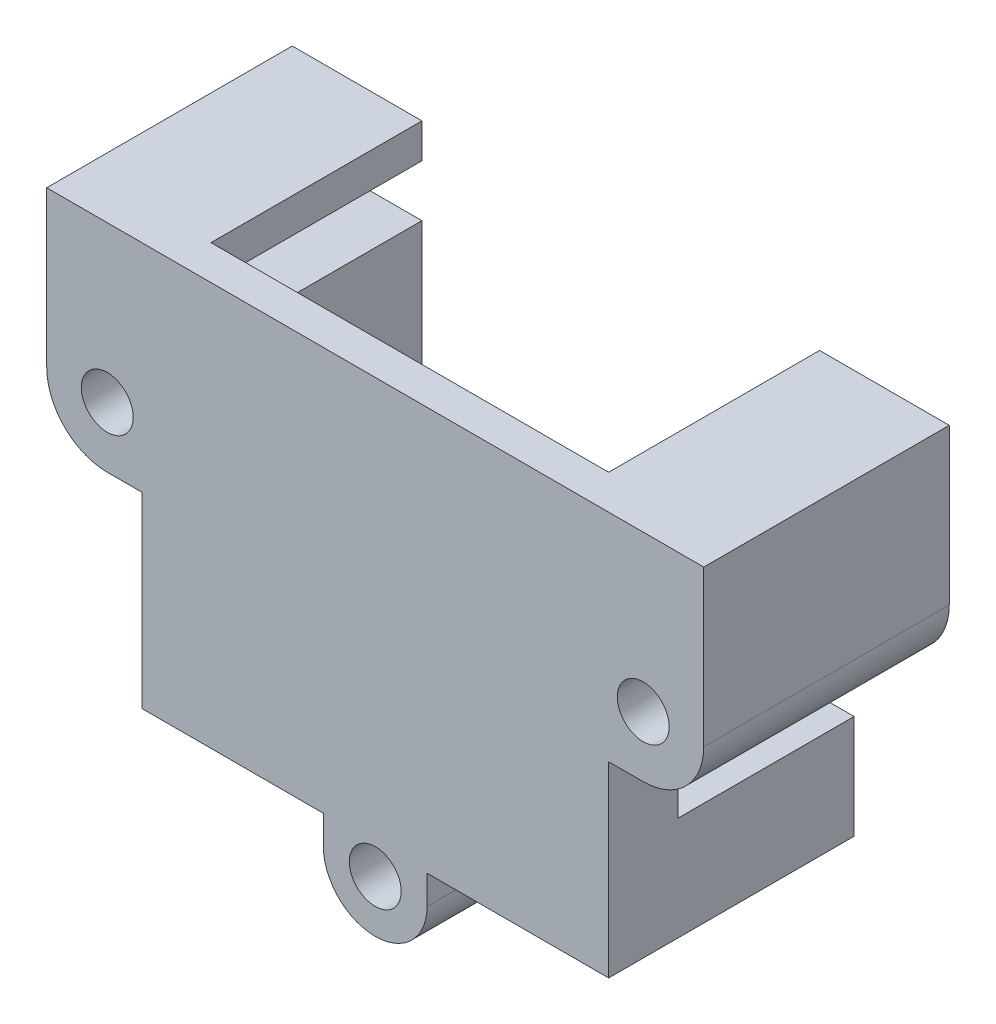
ISO-10303-21;
HEADER;
FILE_DESCRIPTION(('STEP AP214'),'2;1');
FILE_NAME('part.step','',(''),(''),'','','');
FILE_SCHEMA(('AUTOMOTIVE_DESIGN { 1 0 10303 214 1 1 1 1 }'));
ENDSEC;
DATA;
#1=APPLICATION_CONTEXT('core data for automotive mechanical design processes');
#2=APPLICATION_PROTOCOL_DEFINITION('international standard','automotive_design',2000,#1);
#3=PRODUCT_CONTEXT('',#1,'mechanical');
#4=PRODUCT('Part','Part','',(#3));
#5=PRODUCT_RELATED_PRODUCT_CATEGORY('part','',(#4));
#6=PRODUCT_DEFINITION_FORMATION('','',#4);
#7=PRODUCT_DEFINITION_CONTEXT('part definition',#1,'design');
#8=PRODUCT_DEFINITION('design','',#6,#7);
#9=PRODUCT_DEFINITION_SHAPE('','',#8);
#10=(LENGTH_UNIT() NAMED_UNIT(*) SI_UNIT(.MILLI.,.METRE.));
#11=(NAMED_UNIT(*) PLANE_ANGLE_UNIT() SI_UNIT($,.RADIAN.));
#12=(NAMED_UNIT(*) SI_UNIT($,.STERADIAN.) SOLID_ANGLE_UNIT());
#13=UNCERTAINTY_MEASURE_WITH_UNIT(LENGTH_MEASURE(1.E-05),#10,'distance_accuracy_value','');
#14=(GEOMETRIC_REPRESENTATION_CONTEXT(3) GLOBAL_UNCERTAINTY_ASSIGNED_CONTEXT((#13)) GLOBAL_UNIT_ASSIGNED_CONTEXT((#10,
#11,#12)) REPRESENTATION_CONTEXT('',''));
#15=CARTESIAN_POINT('',(0.,0.,0.));
#16=DIRECTION('',(0.,0.,1.));
#17=DIRECTION('',(1.,0.,0.));
#18=AXIS2_PLACEMENT_3D('',#15,#16,#17);
#19=CARTESIAN_POINT('',(-15.5,13.5,8.));
#20=DIRECTION('',(0.,0.,1.));
#21=DIRECTION('',(1.,0.,0.));
#22=AXIS2_PLACEMENT_3D('',#19,#20,#21);
#23=PLANE('',#22);
#24=DIRECTION('',(0.,-1.,0.));
#25=VECTOR('',#24,1.);
#26=CARTESIAN_POINT('',(11.5,17.5,8.));
#27=LINE('',#26,#25);
#28=CARTESIAN_POINT('',(11.5,17.5,8.));
#29=VERTEX_POINT('',#28);
#30=CARTESIAN_POINT('',(11.5,0.499999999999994,8.));
#31=VERTEX_POINT('',#30);
#32=EDGE_CURVE('E443',#29,#31,#27,.T.);
#33=ORIENTED_EDGE('',*,*,#32,.T.);
#34=DIRECTION('',(-1.,0.,0.));
#35=VECTOR('',#34,1.);
#36=CARTESIAN_POINT('',(11.5,0.499999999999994,8.));
#37=LINE('',#36,#35);
#38=CARTESIAN_POINT('',(-11.5,0.499999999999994,8.));
#39=VERTEX_POINT('',#38);
#40=EDGE_CURVE('E389',#31,#39,#37,.T.);
#41=ORIENTED_EDGE('',*,*,#40,.T.);
#42=DIRECTION('',(0.,1.,0.));
#43=VECTOR('',#42,1.);
#44=CARTESIAN_POINT('',(-11.5,0.499999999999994,8.));
#45=LINE('',#44,#43);
#46=CARTESIAN_POINT('',(-11.5,17.5,8.));
#47=VERTEX_POINT('',#46);
#48=EDGE_CURVE('E391',#39,#47,#45,.T.);
#49=ORIENTED_EDGE('',*,*,#48,.T.);
#50=DIRECTION('',(-1.,0.,0.));
#51=VECTOR('',#50,1.);
#52=CARTESIAN_POINT('',(-11.5,17.5,8.));
#53=LINE('',#52,#51);
#54=CARTESIAN_POINT('',(-17.,17.5,8.));
#55=VERTEX_POINT('',#54);
#56=EDGE_CURVE('E377',#47,#55,#53,.T.);
#57=ORIENTED_EDGE('',*,*,#56,.T.);
#58=DIRECTION('',(0.,1.,0.));
#59=VECTOR('',#58,1.);
#60=CARTESIAN_POINT('',(-17.,17.5,8.));
#61=LINE('',#60,#59);
#62=CARTESIAN_POINT('',(-17.,20.5,8.));
#63=VERTEX_POINT('',#62);
#64=EDGE_CURVE('E380',#55,#63,#61,.T.);
#65=ORIENTED_EDGE('',*,*,#64,.T.);
#66=DIRECTION('',(1.,0.,0.));
#67=VECTOR('',#66,1.);
#68=CARTESIAN_POINT('',(-11.5,20.5,8.));
#69=LINE('',#68,#67);
#70=CARTESIAN_POINT('',(-11.5,20.5,8.));
#71=VERTEX_POINT('',#70);
#72=EDGE_CURVE('E383',#63,#71,#69,.T.);
#73=ORIENTED_EDGE('',*,*,#72,.T.);
#74=DIRECTION('',(0.,1.,0.));
#75=VECTOR('',#74,1.);
#76=CARTESIAN_POINT('',(-11.5,22.5,8.));
#77=LINE('',#76,#75);
#78=CARTESIAN_POINT('',(-11.5,22.5,8.));
#79=VERTEX_POINT('',#78);
#80=EDGE_CURVE('E386',#71,#79,#77,.T.);
#81=ORIENTED_EDGE('',*,*,#80,.T.);
#82=DIRECTION('',(-1.,0.,0.));
#83=VECTOR('',#82,1.);
#84=CARTESIAN_POINT('',(-11.5,22.5,8.));
#85=LINE('',#84,#83);
#86=CARTESIAN_POINT('',(11.5,22.5,8.));
#87=VERTEX_POINT('',#86);
#88=EDGE_CURVE('E413',#87,#79,#85,.T.);
#89=ORIENTED_EDGE('',*,*,#88,.F.);
#90=DIRECTION('',(0.,-1.,0.));
#91=VECTOR('',#90,1.);
#92=CARTESIAN_POINT('',(11.5,22.5,8.));
#93=LINE('',#92,#91);
#94=CARTESIAN_POINT('',(11.5,20.5,8.));
#95=VERTEX_POINT('',#94);
#96=EDGE_CURVE('E445',#87,#95,#93,.T.);
#97=ORIENTED_EDGE('',*,*,#96,.T.);
#98=DIRECTION('',(1.,0.,0.));
#99=VECTOR('',#98,1.);
#100=CARTESIAN_POINT('',(11.5,20.5,8.));
#101=LINE('',#100,#99);
#102=CARTESIAN_POINT('',(17.,20.5,8.));
#103=VERTEX_POINT('',#102);
#104=EDGE_CURVE('E448',#95,#103,#101,.T.);
#105=ORIENTED_EDGE('',*,*,#104,.T.);
#106=DIRECTION('',(0.,-1.,0.));
#107=VECTOR('',#106,1.);
#108=CARTESIAN_POINT('',(17.,20.5,8.));
#109=LINE('',#108,#107);
#110=CARTESIAN_POINT('',(17.,17.5,8.));
#111=VERTEX_POINT('',#110);
#112=EDGE_CURVE('E451',#103,#111,#109,.T.);
#113=ORIENTED_EDGE('',*,*,#112,.T.);
#114=DIRECTION('',(-1.,0.,0.));
#115=VECTOR('',#114,1.);
#116=CARTESIAN_POINT('',(17.,17.5,8.));
#117=LINE('',#116,#115);
#118=EDGE_CURVE('E440',#111,#29,#117,.T.);
#119=ORIENTED_EDGE('',*,*,#118,.T.);
#120=EDGE_LOOP('',(#33,#41,#49,#57,#65,#73,#81,#89,#97,#105,#113,#119));
#121=FACE_BOUND('',#120,.T.);
#122=ADVANCED_FACE('F33',(#121),#23,.F.);
#123=CARTESIAN_POINT('',(11.5,8.5,8.));
#124=DIRECTION('',(0.,1.,0.));
#125=DIRECTION('',(0.,0.,1.));
#126=AXIS2_PLACEMENT_3D('',#123,#124,#125);
#127=PLANE('',#126);
#128=DIRECTION('',(1.,0.,0.));
#129=VECTOR('',#128,1.);
#130=CARTESIAN_POINT('',(13.5,8.5,6.));
#131=LINE('',#130,#129);
#132=CARTESIAN_POINT('',(11.5,8.5,6.));
#133=VERTEX_POINT('',#132);
#134=CARTESIAN_POINT('',(13.5,8.5,6.));
#135=VERTEX_POINT('',#134);
#136=EDGE_CURVE('E369',#133,#135,#131,.T.);
#137=ORIENTED_EDGE('',*,*,#136,.F.);
#138=DIRECTION('',(0.,0.,-1.));
#139=VECTOR('',#138,1.);
#140=CARTESIAN_POINT('',(11.5,8.5,8.));
#141=LINE('',#140,#139);
#142=CARTESIAN_POINT('',(11.5,8.5,-4.2));
#143=VERTEX_POINT('',#142);
#144=EDGE_CURVE('E42',#133,#143,#141,.T.);
#145=ORIENTED_EDGE('',*,*,#144,.T.);
#146=DIRECTION('',(-1.,0.,0.));
#147=VECTOR('',#146,1.);
#148=CARTESIAN_POINT('',(13.5,8.5,-4.2));
#149=LINE('',#148,#147);
#150=CARTESIAN_POINT('',(13.5,8.5,-4.2));
#151=VERTEX_POINT('',#150);
#152=EDGE_CURVE('E329',#151,#143,#149,.T.);
#153=ORIENTED_EDGE('',*,*,#152,.F.);
#154=DIRECTION('',(0.,0.,-1.));
#155=VECTOR('',#154,1.);
#156=CARTESIAN_POINT('',(13.5,8.5,8.));
#157=LINE('',#156,#155);
#158=EDGE_CURVE('E464',#135,#151,#157,.T.);
#159=ORIENTED_EDGE('',*,*,#158,.F.);
#160=EDGE_LOOP('',(#137,#145,#153,#159));
#161=FACE_BOUND('',#160,.T.);
#162=ADVANCED_FACE('F495',(#161),#127,.F.);
#163=CARTESIAN_POINT('',(13.5,5.16666666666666,8.));
#164=DIRECTION('',(0.,-1.,0.));
#165=DIRECTION('',(0.,0.,-1.));
#166=AXIS2_PLACEMENT_3D('',#163,#164,#165);
#167=PLANE('',#166);
#168=DIRECTION('',(-1.,0.,0.));
#169=VECTOR('',#168,1.);
#170=CARTESIAN_POINT('',(11.5,5.16666666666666,6.));
#171=LINE('',#170,#169);
#172=CARTESIAN_POINT('',(13.5,5.16666666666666,6.));
#173=VERTEX_POINT('',#172);
#174=CARTESIAN_POINT('',(11.5,5.16666666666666,6.));
#175=VERTEX_POINT('',#174);
#176=EDGE_CURVE('E374',#173,#175,#171,.T.);
#177=ORIENTED_EDGE('',*,*,#176,.F.);
#178=DIRECTION('',(0.,0.,-1.));
#179=VECTOR('',#178,1.);
#180=CARTESIAN_POINT('',(13.5,5.16666666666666,8.));
#181=LINE('',#180,#179);
#182=CARTESIAN_POINT('',(13.5,5.16666666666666,-4.2));
#183=VERTEX_POINT('',#182);
#184=EDGE_CURVE('E403',#173,#183,#181,.T.);
#185=ORIENTED_EDGE('',*,*,#184,.T.);
#186=DIRECTION('',(1.,0.,0.));
#187=VECTOR('',#186,1.);
#188=CARTESIAN_POINT('',(11.5,5.16666666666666,-4.2));
#189=LINE('',#188,#187);
#190=CARTESIAN_POINT('',(11.5,5.16666666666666,-4.2));
#191=VERTEX_POINT('',#190);
#192=EDGE_CURVE('E346',#191,#183,#189,.T.);
#193=ORIENTED_EDGE('',*,*,#192,.F.);
#194=DIRECTION('',(0.,0.,-1.));
#195=VECTOR('',#194,1.);
#196=CARTESIAN_POINT('',(11.5,5.16666666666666,8.));
#197=LINE('',#196,#195);
#198=EDGE_CURVE('E401',#175,#191,#197,.T.);
#199=ORIENTED_EDGE('',*,*,#198,.F.);
#200=EDGE_LOOP('',(#177,#185,#193,#199));
#201=FACE_BOUND('',#200,.T.);
#202=ADVANCED_FACE('F503',(#201),#167,.F.);
#203=CARTESIAN_POINT('',(17.,17.5,8.));
#204=DIRECTION('',(0.,-1.,0.));
#205=DIRECTION('',(1.,0.,0.));
#206=AXIS2_PLACEMENT_3D('',#203,#204,#205);
#207=PLANE('',#206);
#208=DIRECTION('',(0.,0.,-1.));
#209=VECTOR('',#208,1.);
#210=CARTESIAN_POINT('',(17.,17.5,8.));
#211=LINE('',#210,#209);
#212=CARTESIAN_POINT('',(17.,17.5,-4.2));
#213=VERTEX_POINT('',#212);
#214=EDGE_CURVE('E454',#111,#213,#211,.T.);
#215=ORIENTED_EDGE('',*,*,#214,.T.);
#216=DIRECTION('',(1.,0.,0.));
#217=VECTOR('',#216,1.);
#218=CARTESIAN_POINT('',(11.5,17.5,-4.2));
#219=LINE('',#218,#217);
#220=CARTESIAN_POINT('',(11.5,17.5,-4.2));
#221=VERTEX_POINT('',#220);
#222=EDGE_CURVE('E310',#221,#213,#219,.T.);
#223=ORIENTED_EDGE('',*,*,#222,.F.);
#224=DIRECTION('',(0.,0.,-1.));
#225=VECTOR('',#224,1.);
#226=CARTESIAN_POINT('',(11.5,17.5,8.));
#227=LINE('',#226,#225);
#228=EDGE_CURVE('E11',#29,#221,#227,.T.);
#229=ORIENTED_EDGE('',*,*,#228,.F.);
#230=ORIENTED_EDGE('',*,*,#118,.F.);
#231=EDGE_LOOP('',(#215,#223,#229,#230));
#232=FACE_BOUND('',#231,.T.);
#233=ADVANCED_FACE('F35',(#232),#207,.F.);
#234=CARTESIAN_POINT('',(11.5,17.5,8.));
#235=DIRECTION('',(1.,0.,0.));
#236=DIRECTION('',(0.,0.,-1.));
#237=AXIS2_PLACEMENT_3D('',#234,#235,#236);
#238=PLANE('',#237);
#239=ORIENTED_EDGE('',*,*,#228,.T.);
#240=DIRECTION('',(0.,1.,0.));
#241=VECTOR('',#240,1.);
#242=CARTESIAN_POINT('',(11.5,8.5,-4.2));
#243=LINE('',#242,#241);
#244=EDGE_CURVE('E307',#143,#221,#243,.T.);
#245=ORIENTED_EDGE('',*,*,#244,.F.);
#246=ORIENTED_EDGE('',*,*,#144,.F.);
#247=DIRECTION('',(0.,1.,0.));
#248=VECTOR('',#247,1.);
#249=CARTESIAN_POINT('',(11.5,8.5,6.));
#250=LINE('',#249,#248);
#251=EDGE_CURVE('E58',#175,#133,#250,.T.);
#252=ORIENTED_EDGE('',*,*,#251,.F.);
#253=ORIENTED_EDGE('',*,*,#198,.T.);
#254=DIRECTION('',(0.,1.,0.));
#255=VECTOR('',#254,1.);
#256=CARTESIAN_POINT('',(11.5,0.499999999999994,-4.2));
#257=LINE('',#256,#255);
#258=CARTESIAN_POINT('',(11.5,0.499999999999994,-4.2));
#259=VERTEX_POINT('',#258);
#260=EDGE_CURVE('E343',#259,#191,#257,.T.);
#261=ORIENTED_EDGE('',*,*,#260,.F.);
#262=DIRECTION('',(0.,0.,-1.));
#263=VECTOR('',#262,1.);
#264=CARTESIAN_POINT('',(11.5,0.499999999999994,8.));
#265=LINE('',#264,#263);
#266=EDGE_CURVE('E398',#31,#259,#265,.T.);
#267=ORIENTED_EDGE('',*,*,#266,.F.);
#268=ORIENTED_EDGE('',*,*,#32,.F.);
#269=EDGE_LOOP('',(#239,#245,#246,#252,#253,#261,#267,#268));
#270=FACE_BOUND('',#269,.T.);
#271=ADVANCED_FACE('F549',(#270),#238,.F.);
#272=CARTESIAN_POINT('',(13.5,11.5,8.));
#273=DIRECTION('',(-1.,0.,0.));
#274=DIRECTION('',(0.,-1.,0.));
#275=AXIS2_PLACEMENT_3D('',#272,#273,#274);
#276=PLANE('',#275);
#277=DIRECTION('',(0.,-1.,0.));
#278=VECTOR('',#277,1.);
#279=CARTESIAN_POINT('',(13.5,11.5,-4.2));
#280=LINE('',#279,#278);
#281=CARTESIAN_POINT('',(13.5,10.,-4.2));
#282=VERTEX_POINT('',#281);
#283=EDGE_CURVE('E327',#282,#151,#280,.T.);
#284=ORIENTED_EDGE('',*,*,#283,.F.);
#285=DIRECTION('',(0.,0.,-1.));
#286=VECTOR('',#285,1.);
#287=CARTESIAN_POINT('',(13.5,10.,19.8994949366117));
#288=LINE('',#287,#286);
#289=CARTESIAN_POINT('',(13.5,10.,10.));
#290=VERTEX_POINT('',#289);
#291=EDGE_CURVE('E277',#290,#282,#288,.T.);
#292=ORIENTED_EDGE('',*,*,#291,.F.);
#293=DIRECTION('',(0.,1.,0.));
#294=VECTOR('',#293,1.);
#295=CARTESIAN_POINT('',(13.5,-0.833333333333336,10.));
#296=LINE('',#295,#294);
#297=CARTESIAN_POINT('',(13.5,-0.833333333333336,10.));
#298=VERTEX_POINT('',#297);
#299=EDGE_CURVE('E428',#298,#290,#296,.T.);
#300=ORIENTED_EDGE('',*,*,#299,.F.);
#301=DIRECTION('',(0.,0.,-1.));
#302=VECTOR('',#301,1.);
#303=CARTESIAN_POINT('',(13.5,-0.833333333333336,10.));
#304=LINE('',#303,#302);
#305=CARTESIAN_POINT('',(13.5,-0.833333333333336,-4.2));
#306=VERTEX_POINT('',#305);
#307=EDGE_CURVE('E431',#298,#306,#304,.T.);
#308=ORIENTED_EDGE('',*,*,#307,.T.);
#309=DIRECTION('',(0.,-1.,0.));
#310=VECTOR('',#309,1.);
#311=CARTESIAN_POINT('',(13.5,5.16666666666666,-4.2));
#312=LINE('',#311,#310);
#313=EDGE_CURVE('E349',#183,#306,#312,.T.);
#314=ORIENTED_EDGE('',*,*,#313,.F.);
#315=ORIENTED_EDGE('',*,*,#184,.F.);
#316=DIRECTION('',(0.,-1.,0.));
#317=VECTOR('',#316,1.);
#318=CARTESIAN_POINT('',(13.5,5.16666666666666,6.));
#319=LINE('',#318,#317);
#320=EDGE_CURVE('E372',#135,#173,#319,.T.);
#321=ORIENTED_EDGE('',*,*,#320,.F.);
#322=ORIENTED_EDGE('',*,*,#158,.T.);
#323=EDGE_LOOP('',(#284,#292,#300,#308,#314,#315,#321,#322));
#324=FACE_BOUND('',#323,.T.);
#325=ADVANCED_FACE('F546',(#324),#276,.F.);
#326=CARTESIAN_POINT('',(19.,20.5,8.));
#327=DIRECTION('',(-1.,0.,0.));
#328=DIRECTION('',(0.,0.,1.));
#329=AXIS2_PLACEMENT_3D('',#326,#327,#328);
#330=PLANE('',#329);
#331=DIRECTION('',(0.,1.,0.));
#332=VECTOR('',#331,1.);
#333=CARTESIAN_POINT('',(19.,15.5,10.));
#334=LINE('',#333,#332);
#335=CARTESIAN_POINT('',(19.,13.5,10.));
#336=VERTEX_POINT('',#335);
#337=CARTESIAN_POINT('',(19.,22.5,10.));
#338=VERTEX_POINT('',#337);
#339=EDGE_CURVE('E414',#336,#338,#334,.T.);
#340=ORIENTED_EDGE('',*,*,#339,.F.);
#341=DIRECTION('',(0.,0.,-1.));
#342=VECTOR('',#341,1.);
#343=CARTESIAN_POINT('',(19.,13.5,19.8994949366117));
#344=LINE('',#343,#342);
#345=CARTESIAN_POINT('',(19.,13.5,-4.2));
#346=VERTEX_POINT('',#345);
#347=EDGE_CURVE('E282',#336,#346,#344,.T.);
#348=ORIENTED_EDGE('',*,*,#347,.T.);
#349=DIRECTION('',(0.,-1.,0.));
#350=VECTOR('',#349,1.);
#351=CARTESIAN_POINT('',(19.,22.5,-4.2));
#352=LINE('',#351,#350);
#353=CARTESIAN_POINT('',(19.,22.5,-4.2));
#354=VERTEX_POINT('',#353);
#355=EDGE_CURVE('E325',#354,#346,#352,.T.);
#356=ORIENTED_EDGE('',*,*,#355,.F.);
#357=DIRECTION('',(0.,0.,-1.));
#358=VECTOR('',#357,1.);
#359=CARTESIAN_POINT('',(19.,22.5,8.));
#360=LINE('',#359,#358);
#361=EDGE_CURVE('E462',#338,#354,#360,.T.);
#362=ORIENTED_EDGE('',*,*,#361,.F.);
#363=EDGE_LOOP('',(#340,#348,#356,#362));
#364=FACE_BOUND('',#363,.T.);
#365=ADVANCED_FACE('F542',(#364),#330,.F.);
#366=CARTESIAN_POINT('',(19.,22.5,8.));
#367=DIRECTION('',(0.,-1.,0.));
#368=DIRECTION('',(0.,0.,-1.));
#369=AXIS2_PLACEMENT_3D('',#366,#367,#368);
#370=PLANE('',#369);
#371=ORIENTED_EDGE('',*,*,#361,.T.);
#372=DIRECTION('',(1.,0.,0.));
#373=VECTOR('',#372,1.);
#374=CARTESIAN_POINT('',(11.5,22.5,-4.2));
#375=LINE('',#374,#373);
#376=CARTESIAN_POINT('',(11.5,22.5,-4.2));
#377=VERTEX_POINT('',#376);
#378=EDGE_CURVE('E322',#377,#354,#375,.T.);
#379=ORIENTED_EDGE('',*,*,#378,.F.);
#380=DIRECTION('',(0.,0.,-1.));
#381=VECTOR('',#380,1.);
#382=CARTESIAN_POINT('',(11.5,22.5,8.));
#383=LINE('',#382,#381);
#384=EDGE_CURVE('E460',#87,#377,#383,.T.);
#385=ORIENTED_EDGE('',*,*,#384,.F.);
#386=ORIENTED_EDGE('',*,*,#88,.T.);
#387=DIRECTION('',(0.,0.,-1.));
#388=VECTOR('',#387,1.);
#389=CARTESIAN_POINT('',(-11.5,22.5,8.));
#390=LINE('',#389,#388);
#391=CARTESIAN_POINT('',(-11.5,22.5,-4.2));
#392=VERTEX_POINT('',#391);
#393=EDGE_CURVE('E405',#79,#392,#390,.T.);
#394=ORIENTED_EDGE('',*,*,#393,.T.);
#395=DIRECTION('',(1.,0.,0.));
#396=VECTOR('',#395,1.);
#397=CARTESIAN_POINT('',(-19.,22.5,-4.2));
#398=LINE('',#397,#396);
#399=CARTESIAN_POINT('',(-19.,22.5,-4.2));
#400=VERTEX_POINT('',#399);
#401=EDGE_CURVE('E360',#400,#392,#398,.T.);
#402=ORIENTED_EDGE('',*,*,#401,.F.);
#403=DIRECTION('',(0.,0.,-1.));
#404=VECTOR('',#403,1.);
#405=CARTESIAN_POINT('',(-19.,22.5,10.));
#406=LINE('',#405,#404);
#407=CARTESIAN_POINT('',(-19.,22.5,10.));
#408=VERTEX_POINT('',#407);
#409=EDGE_CURVE('E438',#408,#400,#406,.T.);
#410=ORIENTED_EDGE('',*,*,#409,.F.);
#411=DIRECTION('',(-1.,0.,0.));
#412=VECTOR('',#411,1.);
#413=CARTESIAN_POINT('',(19.,22.5,10.));
#414=LINE('',#413,#412);
#415=EDGE_CURVE('E417',#338,#408,#414,.T.);
#416=ORIENTED_EDGE('',*,*,#415,.F.);
#417=EDGE_LOOP('',(#371,#379,#385,#386,#394,#402,#410,#416));
#418=FACE_BOUND('',#417,.T.);
#419=ADVANCED_FACE('F538',(#418),#370,.F.);
#420=CARTESIAN_POINT('',(11.5,22.5,8.));
#421=DIRECTION('',(1.,0.,0.));
#422=DIRECTION('',(0.,0.,-1.));
#423=AXIS2_PLACEMENT_3D('',#420,#421,#422);
#424=PLANE('',#423);
#425=ORIENTED_EDGE('',*,*,#384,.T.);
#426=DIRECTION('',(0.,1.,0.));
#427=VECTOR('',#426,1.);
#428=CARTESIAN_POINT('',(11.5,20.5,-4.2));
#429=LINE('',#428,#427);
#430=CARTESIAN_POINT('',(11.5,20.5,-4.2));
#431=VERTEX_POINT('',#430);
#432=EDGE_CURVE('E319',#431,#377,#429,.T.);
#433=ORIENTED_EDGE('',*,*,#432,.F.);
#434=DIRECTION('',(0.,0.,-1.));
#435=VECTOR('',#434,1.);
#436=CARTESIAN_POINT('',(11.5,20.5,8.));
#437=LINE('',#436,#435);
#438=EDGE_CURVE('E458',#95,#431,#437,.T.);
#439=ORIENTED_EDGE('',*,*,#438,.F.);
#440=ORIENTED_EDGE('',*,*,#96,.F.);
#441=EDGE_LOOP('',(#425,#433,#439,#440));
#442=FACE_BOUND('',#441,.T.);
#443=ADVANCED_FACE('F534',(#442),#424,.F.);
#444=CARTESIAN_POINT('',(11.5,20.5,8.));
#445=DIRECTION('',(0.,1.,0.));
#446=DIRECTION('',(-1.,0.,0.));
#447=AXIS2_PLACEMENT_3D('',#444,#445,#446);
#448=PLANE('',#447);
#449=ORIENTED_EDGE('',*,*,#438,.T.);
#450=DIRECTION('',(-1.,0.,0.));
#451=VECTOR('',#450,1.);
#452=CARTESIAN_POINT('',(17.,20.5,-4.2));
#453=LINE('',#452,#451);
#454=CARTESIAN_POINT('',(17.,20.5,-4.2));
#455=VERTEX_POINT('',#454);
#456=EDGE_CURVE('E316',#455,#431,#453,.T.);
#457=ORIENTED_EDGE('',*,*,#456,.F.);
#458=DIRECTION('',(0.,0.,-1.));
#459=VECTOR('',#458,1.);
#460=CARTESIAN_POINT('',(17.,20.5,8.));
#461=LINE('',#460,#459);
#462=EDGE_CURVE('E456',#103,#455,#461,.T.);
#463=ORIENTED_EDGE('',*,*,#462,.F.);
#464=ORIENTED_EDGE('',*,*,#104,.F.);
#465=EDGE_LOOP('',(#449,#457,#463,#464));
#466=FACE_BOUND('',#465,.T.);
#467=ADVANCED_FACE('F530',(#466),#448,.F.);
#468=CARTESIAN_POINT('',(17.,20.5,8.));
#469=DIRECTION('',(1.,0.,0.));
#470=DIRECTION('',(0.,0.,-1.));
#471=AXIS2_PLACEMENT_3D('',#468,#469,#470);
#472=PLANE('',#471);
#473=ORIENTED_EDGE('',*,*,#462,.T.);
#474=DIRECTION('',(0.,1.,0.));
#475=VECTOR('',#474,1.);
#476=CARTESIAN_POINT('',(17.,17.5,-4.2));
#477=LINE('',#476,#475);
#478=EDGE_CURVE('E313',#213,#455,#477,.T.);
#479=ORIENTED_EDGE('',*,*,#478,.F.);
#480=ORIENTED_EDGE('',*,*,#214,.F.);
#481=ORIENTED_EDGE('',*,*,#112,.F.);
#482=EDGE_LOOP('',(#473,#479,#480,#481));
#483=FACE_BOUND('',#482,.T.);
#484=ADVANCED_FACE('F527',(#483),#472,.F.);
#485=CARTESIAN_POINT('',(-15.5,13.5,10.));
#486=DIRECTION('',(0.,0.,1.));
#487=DIRECTION('',(1.,0.,0.));
#488=AXIS2_PLACEMENT_3D('',#485,#486,#487);
#489=PLANE('',#488);
#490=CARTESIAN_POINT('',(15.5,13.5,10.));
#491=DIRECTION('',(0.,0.,-1.));
#492=DIRECTION('',(-1.,0.,0.));
#493=AXIS2_PLACEMENT_3D('',#490,#491,#492);
#494=CIRCLE('',#493,1.5);
#495=CARTESIAN_POINT('',(14.,13.5,10.));
#496=VERTEX_POINT('',#495);
#497=EDGE_CURVE('E470',#496,#496,#494,.T.);
#498=ORIENTED_EDGE('',*,*,#497,.T.);
#499=EDGE_LOOP('',(#498));
#500=FACE_BOUND('',#499,.T.);
#501=CARTESIAN_POINT('',(0.,-2.50000000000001,10.));
#502=DIRECTION('',(0.,0.,-1.));
#503=DIRECTION('',(-1.,0.,0.));
#504=AXIS2_PLACEMENT_3D('',#501,#502,#503);
#505=CIRCLE('',#504,1.5);
#506=CARTESIAN_POINT('',(-1.5,-2.50000000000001,10.));
#507=VERTEX_POINT('',#506);
#508=EDGE_CURVE('E1027',#507,#507,#505,.T.);
#509=ORIENTED_EDGE('',*,*,#508,.T.);
#510=EDGE_LOOP('',(#509));
#511=FACE_BOUND('',#510,.T.);
#512=CARTESIAN_POINT('',(-15.5,13.5,10.));
#513=DIRECTION('',(0.,0.,-1.));
#514=DIRECTION('',(-1.,0.,0.));
#515=AXIS2_PLACEMENT_3D('',#512,#513,#514);
#516=CIRCLE('',#515,1.5);
#517=CARTESIAN_POINT('',(-17.,13.5,10.));
#518=VERTEX_POINT('',#517);
#519=EDGE_CURVE('E1029',#518,#518,#516,.T.);
#520=ORIENTED_EDGE('',*,*,#519,.T.);
#521=EDGE_LOOP('',(#520));
#522=FACE_BOUND('',#521,.T.);
#523=DIRECTION('',(1.,0.,0.));
#524=VECTOR('',#523,1.);
#525=CARTESIAN_POINT('',(-13.5,-0.833333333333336,10.));
#526=LINE('',#525,#524);
#527=CARTESIAN_POINT('',(-13.5,-0.833333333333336,10.));
#528=VERTEX_POINT('',#527);
#529=CARTESIAN_POINT('',(-3.,-0.833333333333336,10.));
#530=VERTEX_POINT('',#529);
#531=EDGE_CURVE('E423',#528,#530,#526,.T.);
#532=ORIENTED_EDGE('',*,*,#531,.T.);
#533=DIRECTION('',(0.,1.,0.));
#534=VECTOR('',#533,1.);
#535=CARTESIAN_POINT('',(-3.,0.499999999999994,10.));
#536=LINE('',#535,#534);
#537=CARTESIAN_POINT('',(-3.,-2.50000000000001,10.));
#538=VERTEX_POINT('',#537);
#539=EDGE_CURVE('E238',#538,#530,#536,.T.);
#540=ORIENTED_EDGE('',*,*,#539,.F.);
#541=CARTESIAN_POINT('',(0.,-2.50000000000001,10.));
#542=DIRECTION('',(0.,0.,1.));
#543=DIRECTION('',(1.,0.,0.));
#544=AXIS2_PLACEMENT_3D('',#541,#542,#543);
#545=CIRCLE('',#544,3.);
#546=CARTESIAN_POINT('',(3.,-2.50000000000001,10.));
#547=VERTEX_POINT('',#546);
#548=EDGE_CURVE('E249',#547,#538,#545,.F.);
#549=ORIENTED_EDGE('',*,*,#548,.F.);
#550=DIRECTION('',(0.,-1.,0.));
#551=VECTOR('',#550,1.);
#552=CARTESIAN_POINT('',(3.,-2.50000000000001,10.));
#553=LINE('',#552,#551);
#554=CARTESIAN_POINT('',(3.,-0.833333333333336,10.));
#555=VERTEX_POINT('',#554);
#556=EDGE_CURVE('E245',#555,#547,#553,.T.);
#557=ORIENTED_EDGE('',*,*,#556,.F.);
#558=DIRECTION('',(1.,0.,0.));
#559=VECTOR('',#558,1.);
#560=CARTESIAN_POINT('',(1.88561808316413,-0.833333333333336,10.));
#561=LINE('',#560,#559);
#562=EDGE_CURVE('E426',#555,#298,#561,.T.);
#563=ORIENTED_EDGE('',*,*,#562,.T.);
#564=ORIENTED_EDGE('',*,*,#299,.T.);
#565=DIRECTION('',(-1.,0.,0.));
#566=VECTOR('',#565,1.);
#567=CARTESIAN_POINT('',(15.5,10.,10.));
#568=LINE('',#567,#566);
#569=CARTESIAN_POINT('',(15.5,10.,10.));
#570=VERTEX_POINT('',#569);
#571=EDGE_CURVE('E273',#570,#290,#568,.T.);
#572=ORIENTED_EDGE('',*,*,#571,.F.);
#573=CARTESIAN_POINT('',(15.5,13.5,10.));
#574=DIRECTION('',(0.,0.,1.));
#575=DIRECTION('',(1.,0.,0.));
#576=AXIS2_PLACEMENT_3D('',#573,#574,#575);
#577=CIRCLE('',#576,3.5);
#578=EDGE_CURVE('E278',#336,#570,#577,.F.);
#579=ORIENTED_EDGE('',*,*,#578,.F.);
#580=ORIENTED_EDGE('',*,*,#339,.T.);
#581=ORIENTED_EDGE('',*,*,#415,.T.);
#582=DIRECTION('',(0.,-1.,0.));
#583=VECTOR('',#582,1.);
#584=CARTESIAN_POINT('',(-19.,22.5,10.));
#585=LINE('',#584,#583);
#586=CARTESIAN_POINT('',(-19.,13.5,10.));
#587=VERTEX_POINT('',#586);
#588=EDGE_CURVE('E419',#408,#587,#585,.T.);
#589=ORIENTED_EDGE('',*,*,#588,.T.);
#590=CARTESIAN_POINT('',(-15.5,13.5,10.));
#591=DIRECTION('',(0.,0.,1.));
#592=DIRECTION('',(1.,0.,0.));
#593=AXIS2_PLACEMENT_3D('',#590,#591,#592);
#594=CIRCLE('',#593,3.5);
#595=CARTESIAN_POINT('',(-15.5,10.,10.));
#596=VERTEX_POINT('',#595);
#597=EDGE_CURVE('E294',#596,#587,#594,.F.);
#598=ORIENTED_EDGE('',*,*,#597,.F.);
#599=DIRECTION('',(-1.,0.,0.));
#600=VECTOR('',#599,1.);
#601=CARTESIAN_POINT('',(-15.5,10.,10.));
#602=LINE('',#601,#600);
#603=CARTESIAN_POINT('',(-13.5,10.,10.));
#604=VERTEX_POINT('',#603);
#605=EDGE_CURVE('E299',#604,#596,#602,.T.);
#606=ORIENTED_EDGE('',*,*,#605,.F.);
#607=DIRECTION('',(0.,-1.,0.));
#608=VECTOR('',#607,1.);
#609=CARTESIAN_POINT('',(-13.5,11.5,10.));
#610=LINE('',#609,#608);
#611=EDGE_CURVE('E421',#604,#528,#610,.T.);
#612=ORIENTED_EDGE('',*,*,#611,.T.);
#613=EDGE_LOOP('',(#532,#540,#549,#557,#563,#564,#572,#579,#580,#581,#589,#598,#606,#612));
#614=FACE_BOUND('',#613,.T.);
#615=ADVANCED_FACE('F508',(#500,#511,#522,#614),#489,.T.);
#616=CARTESIAN_POINT('',(-19.,22.5,10.));
#617=DIRECTION('',(1.,0.,0.));
#618=DIRECTION('',(0.,0.,-1.));
#619=AXIS2_PLACEMENT_3D('',#616,#617,#618);
#620=PLANE('',#619);
#621=ORIENTED_EDGE('',*,*,#409,.T.);
#622=DIRECTION('',(0.,1.,0.));
#623=VECTOR('',#622,1.);
#624=CARTESIAN_POINT('',(-19.,15.5,-4.2));
#625=LINE('',#624,#623);
#626=CARTESIAN_POINT('',(-19.,13.5,-4.2));
#627=VERTEX_POINT('',#626);
#628=EDGE_CURVE('E357',#627,#400,#625,.T.);
#629=ORIENTED_EDGE('',*,*,#628,.F.);
#630=DIRECTION('',(0.,0.,-1.));
#631=VECTOR('',#630,1.);
#632=CARTESIAN_POINT('',(-19.,13.5,19.8994949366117));
#633=LINE('',#632,#631);
#634=EDGE_CURVE('E297',#587,#627,#633,.T.);
#635=ORIENTED_EDGE('',*,*,#634,.F.);
#636=ORIENTED_EDGE('',*,*,#588,.F.);
#637=EDGE_LOOP('',(#621,#629,#635,#636));
#638=FACE_BOUND('',#637,.T.);
#639=ADVANCED_FACE('F522',(#638),#620,.F.);
#640=CARTESIAN_POINT('',(-13.5,11.5,10.));
#641=DIRECTION('',(1.,0.,0.));
#642=DIRECTION('',(0.,1.,0.));
#643=AXIS2_PLACEMENT_3D('',#640,#641,#642);
#644=PLANE('',#643);
#645=ORIENTED_EDGE('',*,*,#611,.F.);
#646=DIRECTION('',(0.,0.,-1.));
#647=VECTOR('',#646,1.);
#648=CARTESIAN_POINT('',(-13.5,10.,19.8994949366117));
#649=LINE('',#648,#647);
#650=CARTESIAN_POINT('',(-13.5,10.,-4.2));
#651=VERTEX_POINT('',#650);
#652=EDGE_CURVE('E291',#604,#651,#649,.T.);
#653=ORIENTED_EDGE('',*,*,#652,.T.);
#654=DIRECTION('',(0.,1.,0.));
#655=VECTOR('',#654,1.);
#656=CARTESIAN_POINT('',(-13.5,-0.833333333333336,-4.2));
#657=LINE('',#656,#655);
#658=CARTESIAN_POINT('',(-13.5,-0.833333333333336,-4.2));
#659=VERTEX_POINT('',#658);
#660=EDGE_CURVE('E354',#659,#651,#657,.T.);
#661=ORIENTED_EDGE('',*,*,#660,.F.);
#662=DIRECTION('',(0.,0.,-1.));
#663=VECTOR('',#662,1.);
#664=CARTESIAN_POINT('',(-13.5,-0.833333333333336,10.));
#665=LINE('',#664,#663);
#666=EDGE_CURVE('E435',#528,#659,#665,.T.);
#667=ORIENTED_EDGE('',*,*,#666,.F.);
#668=EDGE_LOOP('',(#645,#653,#661,#667));
#669=FACE_BOUND('',#668,.T.);
#670=ADVANCED_FACE('F518',(#669),#644,.F.);
#671=CARTESIAN_POINT('',(-13.5,-0.833333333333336,10.));
#672=DIRECTION('',(0.,1.,0.));
#673=DIRECTION('',(-1.,0.,0.));
#674=AXIS2_PLACEMENT_3D('',#671,#672,#673);
#675=PLANE('',#674);
#676=DIRECTION('',(-1.,0.,0.));
#677=VECTOR('',#676,1.);
#678=CARTESIAN_POINT('',(-1.88561808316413,-0.833333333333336,-4.2));
#679=LINE('',#678,#677);
#680=CARTESIAN_POINT('',(-3.,-0.833333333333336,-4.2));
#681=VERTEX_POINT('',#680);
#682=EDGE_CURVE('E352',#681,#659,#679,.T.);
#683=ORIENTED_EDGE('',*,*,#682,.F.);
#684=DIRECTION('',(0.,0.,1.));
#685=VECTOR('',#684,1.);
#686=CARTESIAN_POINT('',(-3.,-0.833333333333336,10.));
#687=LINE('',#686,#685);
#688=EDGE_CURVE('E266',#681,#530,#687,.T.);
#689=ORIENTED_EDGE('',*,*,#688,.T.);
#690=ORIENTED_EDGE('',*,*,#531,.F.);
#691=ORIENTED_EDGE('',*,*,#666,.T.);
#692=EDGE_LOOP('',(#683,#689,#690,#691));
#693=FACE_BOUND('',#692,.T.);
#694=ADVANCED_FACE('F514',(#693),#675,.F.);
#695=CARTESIAN_POINT('',(1.88561808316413,-0.833333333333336,10.));
#696=DIRECTION('',(0.,1.,0.));
#697=DIRECTION('',(-1.,0.,0.));
#698=AXIS2_PLACEMENT_3D('',#695,#696,#697);
#699=PLANE('',#698);
#700=ORIENTED_EDGE('',*,*,#562,.F.);
#701=DIRECTION('',(0.,0.,-1.));
#702=VECTOR('',#701,1.);
#703=CARTESIAN_POINT('',(3.,-0.833333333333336,10.));
#704=LINE('',#703,#702);
#705=CARTESIAN_POINT('',(3.,-0.833333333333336,-4.2));
#706=VERTEX_POINT('',#705);
#707=EDGE_CURVE('E264',#555,#706,#704,.T.);
#708=ORIENTED_EDGE('',*,*,#707,.T.);
#709=DIRECTION('',(-1.,0.,0.));
#710=VECTOR('',#709,1.);
#711=CARTESIAN_POINT('',(13.5,-0.833333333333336,-4.2));
#712=LINE('',#711,#710);
#713=EDGE_CURVE('E237',#306,#706,#712,.T.);
#714=ORIENTED_EDGE('',*,*,#713,.F.);
#715=ORIENTED_EDGE('',*,*,#307,.F.);
#716=EDGE_LOOP('',(#700,#708,#714,#715));
#717=FACE_BOUND('',#716,.T.);
#718=ADVANCED_FACE('F510',(#717),#699,.F.);
#719=CARTESIAN_POINT('',(-11.5,17.5,8.));
#720=DIRECTION('',(0.,-1.,0.));
#721=DIRECTION('',(1.,0.,0.));
#722=AXIS2_PLACEMENT_3D('',#719,#720,#721);
#723=PLANE('',#722);
#724=DIRECTION('',(0.,0.,-1.));
#725=VECTOR('',#724,1.);
#726=CARTESIAN_POINT('',(-11.5,17.5,8.));
#727=LINE('',#726,#725);
#728=CARTESIAN_POINT('',(-11.5,17.5,-4.2));
#729=VERTEX_POINT('',#728);
#730=EDGE_CURVE('E394',#47,#729,#727,.T.);
#731=ORIENTED_EDGE('',*,*,#730,.T.);
#732=DIRECTION('',(1.,0.,0.));
#733=VECTOR('',#732,1.);
#734=CARTESIAN_POINT('',(-17.,17.5,-4.2));
#735=LINE('',#734,#733);
#736=CARTESIAN_POINT('',(-17.,17.5,-4.2));
#737=VERTEX_POINT('',#736);
#738=EDGE_CURVE('E335',#737,#729,#735,.T.);
#739=ORIENTED_EDGE('',*,*,#738,.F.);
#740=DIRECTION('',(0.,0.,-1.));
#741=VECTOR('',#740,1.);
#742=CARTESIAN_POINT('',(-17.,17.5,8.));
#743=LINE('',#742,#741);
#744=EDGE_CURVE('E411',#55,#737,#743,.T.);
#745=ORIENTED_EDGE('',*,*,#744,.F.);
#746=ORIENTED_EDGE('',*,*,#56,.F.);
#747=EDGE_LOOP('',(#731,#739,#745,#746));
#748=FACE_BOUND('',#747,.T.);
#749=ADVANCED_FACE('F513',(#748),#723,.F.);
#750=CARTESIAN_POINT('',(-17.,17.5,8.));
#751=DIRECTION('',(-1.,0.,0.));
#752=DIRECTION('',(0.,0.,1.));
#753=AXIS2_PLACEMENT_3D('',#750,#751,#752);
#754=PLANE('',#753);
#755=ORIENTED_EDGE('',*,*,#744,.T.);
#756=DIRECTION('',(0.,-1.,0.));
#757=VECTOR('',#756,1.);
#758=CARTESIAN_POINT('',(-17.,20.5,-4.2));
#759=LINE('',#758,#757);
#760=CARTESIAN_POINT('',(-17.,20.5,-4.2));
#761=VERTEX_POINT('',#760);
#762=EDGE_CURVE('E332',#761,#737,#759,.T.);
#763=ORIENTED_EDGE('',*,*,#762,.F.);
#764=DIRECTION('',(0.,0.,-1.));
#765=VECTOR('',#764,1.);
#766=CARTESIAN_POINT('',(-17.,20.5,8.));
#767=LINE('',#766,#765);
#768=EDGE_CURVE('E409',#63,#761,#767,.T.);
#769=ORIENTED_EDGE('',*,*,#768,.F.);
#770=ORIENTED_EDGE('',*,*,#64,.F.);
#771=EDGE_LOOP('',(#755,#763,#769,#770));
#772=FACE_BOUND('',#771,.T.);
#773=ADVANCED_FACE('F631',(#772),#754,.F.);
#774=CARTESIAN_POINT('',(-11.5,20.5,8.));
#775=DIRECTION('',(0.,1.,0.));
#776=DIRECTION('',(0.,0.,1.));
#777=AXIS2_PLACEMENT_3D('',#774,#775,#776);
#778=PLANE('',#777);
#779=ORIENTED_EDGE('',*,*,#768,.T.);
#780=DIRECTION('',(-1.,0.,0.));
#781=VECTOR('',#780,1.);
#782=CARTESIAN_POINT('',(-11.5,20.5,-4.2));
#783=LINE('',#782,#781);
#784=CARTESIAN_POINT('',(-11.5,20.5,-4.2));
#785=VERTEX_POINT('',#784);
#786=EDGE_CURVE('E366',#785,#761,#783,.T.);
#787=ORIENTED_EDGE('',*,*,#786,.F.);
#788=DIRECTION('',(0.,0.,-1.));
#789=VECTOR('',#788,1.);
#790=CARTESIAN_POINT('',(-11.5,20.5,8.));
#791=LINE('',#790,#789);
#792=EDGE_CURVE('E407',#71,#785,#791,.T.);
#793=ORIENTED_EDGE('',*,*,#792,.F.);
#794=ORIENTED_EDGE('',*,*,#72,.F.);
#795=EDGE_LOOP('',(#779,#787,#793,#794));
#796=FACE_BOUND('',#795,.T.);
#797=ADVANCED_FACE('F627',(#796),#778,.F.);
#798=CARTESIAN_POINT('',(-11.5,22.5,8.));
#799=DIRECTION('',(-1.,0.,0.));
#800=DIRECTION('',(0.,0.,1.));
#801=AXIS2_PLACEMENT_3D('',#798,#799,#800);
#802=PLANE('',#801);
#803=ORIENTED_EDGE('',*,*,#792,.T.);
#804=DIRECTION('',(0.,-1.,0.));
#805=VECTOR('',#804,1.);
#806=CARTESIAN_POINT('',(-11.5,22.5,-4.2));
#807=LINE('',#806,#805);
#808=EDGE_CURVE('E363',#392,#785,#807,.T.);
#809=ORIENTED_EDGE('',*,*,#808,.F.);
#810=ORIENTED_EDGE('',*,*,#393,.F.);
#811=ORIENTED_EDGE('',*,*,#80,.F.);
#812=EDGE_LOOP('',(#803,#809,#810,#811));
#813=FACE_BOUND('',#812,.T.);
#814=ADVANCED_FACE('F624',(#813),#802,.F.);
#815=CARTESIAN_POINT('',(11.5,0.499999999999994,8.));
#816=DIRECTION('',(0.,-1.,0.));
#817=DIRECTION('',(0.,0.,-1.));
#818=AXIS2_PLACEMENT_3D('',#815,#816,#817);
#819=PLANE('',#818);
#820=ORIENTED_EDGE('',*,*,#266,.T.);
#821=DIRECTION('',(1.,0.,0.));
#822=VECTOR('',#821,1.);
#823=CARTESIAN_POINT('',(-11.5,0.499999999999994,-4.2));
#824=LINE('',#823,#822);
#825=CARTESIAN_POINT('',(-11.5,0.499999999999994,-4.2));
#826=VERTEX_POINT('',#825);
#827=EDGE_CURVE('E341',#826,#259,#824,.T.);
#828=ORIENTED_EDGE('',*,*,#827,.F.);
#829=DIRECTION('',(0.,0.,-1.));
#830=VECTOR('',#829,1.);
#831=CARTESIAN_POINT('',(-11.5,0.499999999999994,8.));
#832=LINE('',#831,#830);
#833=EDGE_CURVE('E396',#39,#826,#832,.T.);
#834=ORIENTED_EDGE('',*,*,#833,.F.);
#835=ORIENTED_EDGE('',*,*,#40,.F.);
#836=EDGE_LOOP('',(#820,#828,#834,#835));
#837=FACE_BOUND('',#836,.T.);
#838=ADVANCED_FACE('F579',(#837),#819,.F.);
#839=CARTESIAN_POINT('',(-11.5,0.499999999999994,8.));
#840=DIRECTION('',(-1.,0.,0.));
#841=DIRECTION('',(0.,0.,1.));
#842=AXIS2_PLACEMENT_3D('',#839,#840,#841);
#843=PLANE('',#842);
#844=ORIENTED_EDGE('',*,*,#833,.T.);
#845=DIRECTION('',(0.,-1.,0.));
#846=VECTOR('',#845,1.);
#847=CARTESIAN_POINT('',(-11.5,17.5,-4.2));
#848=LINE('',#847,#846);
#849=EDGE_CURVE('E338',#729,#826,#848,.T.);
#850=ORIENTED_EDGE('',*,*,#849,.F.);
#851=ORIENTED_EDGE('',*,*,#730,.F.);
#852=ORIENTED_EDGE('',*,*,#48,.F.);
#853=EDGE_LOOP('',(#844,#850,#851,#852));
#854=FACE_BOUND('',#853,.T.);
#855=ADVANCED_FACE('F490',(#854),#843,.F.);
#856=CARTESIAN_POINT('',(0.,0.,6.));
#857=DIRECTION('',(0.,0.,1.));
#858=DIRECTION('',(1.,0.,0.));
#859=AXIS2_PLACEMENT_3D('',#856,#857,#858);
#860=PLANE('',#859);
#861=ORIENTED_EDGE('',*,*,#136,.T.);
#862=ORIENTED_EDGE('',*,*,#320,.T.);
#863=ORIENTED_EDGE('',*,*,#176,.T.);
#864=ORIENTED_EDGE('',*,*,#251,.T.);
#865=EDGE_LOOP('',(#861,#862,#863,#864));
#866=FACE_BOUND('',#865,.T.);
#867=ADVANCED_FACE('F479',(#866),#860,.F.);
#868=CARTESIAN_POINT('',(0.,-1.5,-4.2));
#869=DIRECTION('',(0.,0.,-1.));
#870=DIRECTION('',(-1.,0.,0.));
#871=AXIS2_PLACEMENT_3D('',#868,#869,#870);
#872=PLANE('',#871);
#873=CARTESIAN_POINT('',(0.,-2.50000000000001,-4.2));
#874=DIRECTION('',(0.,0.,-1.));
#875=DIRECTION('',(-1.,0.,0.));
#876=AXIS2_PLACEMENT_3D('',#873,#874,#875);
#877=CIRCLE('',#876,1.5);
#878=CARTESIAN_POINT('',(-1.5,-2.50000000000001,-4.2));
#879=VERTEX_POINT('',#878);
#880=EDGE_CURVE('E37',#879,#879,#877,.T.);
#881=ORIENTED_EDGE('',*,*,#880,.F.);
#882=EDGE_LOOP('',(#881));
#883=FACE_BOUND('',#882,.T.);
#884=CARTESIAN_POINT('',(-15.5,13.5,-4.2));
#885=DIRECTION('',(0.,0.,-1.));
#886=DIRECTION('',(-1.,0.,0.));
#887=AXIS2_PLACEMENT_3D('',#884,#885,#886);
#888=CIRCLE('',#887,1.5);
#889=CARTESIAN_POINT('',(-17.,13.5,-4.2));
#890=VERTEX_POINT('',#889);
#891=EDGE_CURVE('E258',#890,#890,#888,.T.);
#892=ORIENTED_EDGE('',*,*,#891,.F.);
#893=EDGE_LOOP('',(#892));
#894=FACE_BOUND('',#893,.T.);
#895=DIRECTION('',(0.,1.,0.));
#896=VECTOR('',#895,1.);
#897=CARTESIAN_POINT('',(-3.,0.499999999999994,-4.2));
#898=LINE('',#897,#896);
#899=CARTESIAN_POINT('',(-3.,-2.50000000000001,-4.2));
#900=VERTEX_POINT('',#899);
#901=EDGE_CURVE('E239',#900,#681,#898,.T.);
#902=ORIENTED_EDGE('',*,*,#901,.T.);
#903=ORIENTED_EDGE('',*,*,#682,.T.);
#904=ORIENTED_EDGE('',*,*,#660,.T.);
#905=DIRECTION('',(-1.,0.,0.));
#906=VECTOR('',#905,1.);
#907=CARTESIAN_POINT('',(-15.5,10.,-4.2));
#908=LINE('',#907,#906);
#909=CARTESIAN_POINT('',(-15.5,10.,-4.2));
#910=VERTEX_POINT('',#909);
#911=EDGE_CURVE('E288',#651,#910,#908,.T.);
#912=ORIENTED_EDGE('',*,*,#911,.T.);
#913=CARTESIAN_POINT('',(-15.5,13.5,-4.2));
#914=DIRECTION('',(0.,0.,-1.));
#915=DIRECTION('',(1.,0.,0.));
#916=AXIS2_PLACEMENT_3D('',#913,#914,#915);
#917=CIRCLE('',#916,3.5);
#918=EDGE_CURVE('E287',#910,#627,#917,.T.);
#919=ORIENTED_EDGE('',*,*,#918,.T.);
#920=ORIENTED_EDGE('',*,*,#628,.T.);
#921=ORIENTED_EDGE('',*,*,#401,.T.);
#922=ORIENTED_EDGE('',*,*,#808,.T.);
#923=ORIENTED_EDGE('',*,*,#786,.T.);
#924=ORIENTED_EDGE('',*,*,#762,.T.);
#925=ORIENTED_EDGE('',*,*,#738,.T.);
#926=ORIENTED_EDGE('',*,*,#849,.T.);
#927=ORIENTED_EDGE('',*,*,#827,.T.);
#928=ORIENTED_EDGE('',*,*,#260,.T.);
#929=ORIENTED_EDGE('',*,*,#192,.T.);
#930=ORIENTED_EDGE('',*,*,#313,.T.);
#931=ORIENTED_EDGE('',*,*,#713,.T.);
#932=DIRECTION('',(0.,-1.,0.));
#933=VECTOR('',#932,1.);
#934=CARTESIAN_POINT('',(3.,-2.50000000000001,-4.2));
#935=LINE('',#934,#933);
#936=CARTESIAN_POINT('',(3.,-2.50000000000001,-4.2));
#937=VERTEX_POINT('',#936);
#938=EDGE_CURVE('E50',#706,#937,#935,.T.);
#939=ORIENTED_EDGE('',*,*,#938,.T.);
#940=CARTESIAN_POINT('',(0.,-2.50000000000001,-4.2));
#941=DIRECTION('',(0.,0.,-1.));
#942=DIRECTION('',(-1.,0.,0.));
#943=AXIS2_PLACEMENT_3D('',#940,#941,#942);
#944=CIRCLE('',#943,3.);
#945=EDGE_CURVE('E234',#937,#900,#944,.T.);
#946=ORIENTED_EDGE('',*,*,#945,.T.);
#947=EDGE_LOOP('',(#902,#903,#904,#912,#919,#920,#921,#922,#923,#924,#925,#926,#927,#928,#929,
#930,#931,#939,#946));
#948=FACE_BOUND('',#947,.T.);
#949=ADVANCED_FACE('F232',(#883,#894,#948),#872,.T.);
#950=CARTESIAN_POINT('',(15.5,13.5,-4.2));
#951=DIRECTION('',(0.,0.,-1.));
#952=DIRECTION('',(-1.,0.,0.));
#953=AXIS2_PLACEMENT_3D('',#950,#951,#952);
#954=PLANE('',#953);
#955=CARTESIAN_POINT('',(15.5,13.5,-4.2));
#956=DIRECTION('',(0.,0.,-1.));
#957=DIRECTION('',(-1.,0.,0.));
#958=AXIS2_PLACEMENT_3D('',#955,#956,#957);
#959=CIRCLE('',#958,1.5);
#960=CARTESIAN_POINT('',(14.,13.5,-4.2));
#961=VERTEX_POINT('',#960);
#962=EDGE_CURVE('E468',#961,#961,#959,.T.);
#963=ORIENTED_EDGE('',*,*,#962,.F.);
#964=EDGE_LOOP('',(#963));
#965=FACE_BOUND('',#964,.T.);
#966=DIRECTION('',(-1.,0.,0.));
#967=VECTOR('',#966,1.);
#968=CARTESIAN_POINT('',(15.5,10.,-4.2));
#969=LINE('',#968,#967);
#970=CARTESIAN_POINT('',(15.5,10.,-4.2));
#971=VERTEX_POINT('',#970);
#972=EDGE_CURVE('E270',#971,#282,#969,.T.);
#973=ORIENTED_EDGE('',*,*,#972,.T.);
#974=ORIENTED_EDGE('',*,*,#283,.T.);
#975=ORIENTED_EDGE('',*,*,#152,.T.);
#976=ORIENTED_EDGE('',*,*,#244,.T.);
#977=ORIENTED_EDGE('',*,*,#222,.T.);
#978=ORIENTED_EDGE('',*,*,#478,.T.);
#979=ORIENTED_EDGE('',*,*,#456,.T.);
#980=ORIENTED_EDGE('',*,*,#432,.T.);
#981=ORIENTED_EDGE('',*,*,#378,.T.);
#982=ORIENTED_EDGE('',*,*,#355,.T.);
#983=CARTESIAN_POINT('',(15.5,13.5,-4.2));
#984=DIRECTION('',(0.,0.,-1.));
#985=DIRECTION('',(-1.,0.,0.));
#986=AXIS2_PLACEMENT_3D('',#983,#984,#985);
#987=CIRCLE('',#986,3.5);
#988=EDGE_CURVE('E269',#346,#971,#987,.T.);
#989=ORIENTED_EDGE('',*,*,#988,.T.);
#990=EDGE_LOOP('',(#973,#974,#975,#976,#977,#978,#979,#980,#981,#982,#989));
#991=FACE_BOUND('',#990,.T.);
#992=ADVANCED_FACE('F478',(#965,#991),#954,.T.);
#993=CARTESIAN_POINT('',(-15.5,13.5,19.8994949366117));
#994=DIRECTION('',(0.,0.,-1.));
#995=DIRECTION('',(-1.,0.,0.));
#996=AXIS2_PLACEMENT_3D('',#993,#994,#995);
#997=CYLINDRICAL_SURFACE('',#996,3.5);
#998=DIRECTION('',(0.,0.,-1.));
#999=VECTOR('',#998,1.);
#1000=CARTESIAN_POINT('',(-15.5,10.,19.8994949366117));
#1001=LINE('',#1000,#999);
#1002=EDGE_CURVE('E298',#596,#910,#1001,.T.);
#1003=ORIENTED_EDGE('',*,*,#1002,.F.);
#1004=ORIENTED_EDGE('',*,*,#597,.T.);
#1005=ORIENTED_EDGE('',*,*,#634,.T.);
#1006=ORIENTED_EDGE('',*,*,#918,.F.);
#1007=EDGE_LOOP('',(#1003,#1004,#1005,#1006));
#1008=FACE_BOUND('',#1007,.T.);
#1009=ADVANCED_FACE('F486',(#1008),#997,.T.);
#1010=CARTESIAN_POINT('',(-15.5,10.,19.8994949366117));
#1011=DIRECTION('',(0.,-1.,0.));
#1012=DIRECTION('',(1.,0.,0.));
#1013=AXIS2_PLACEMENT_3D('',#1010,#1011,#1012);
#1014=PLANE('',#1013);
#1015=ORIENTED_EDGE('',*,*,#652,.F.);
#1016=ORIENTED_EDGE('',*,*,#605,.T.);
#1017=ORIENTED_EDGE('',*,*,#1002,.T.);
#1018=ORIENTED_EDGE('',*,*,#911,.F.);
#1019=EDGE_LOOP('',(#1015,#1016,#1017,#1018));
#1020=FACE_BOUND('',#1019,.T.);
#1021=ADVANCED_FACE('F615',(#1020),#1014,.T.);
#1022=CARTESIAN_POINT('',(15.5,13.5,19.8994949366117));
#1023=DIRECTION('',(0.,0.,-1.));
#1024=DIRECTION('',(-1.,0.,0.));
#1025=AXIS2_PLACEMENT_3D('',#1022,#1023,#1024);
#1026=CYLINDRICAL_SURFACE('',#1025,3.5);
#1027=ORIENTED_EDGE('',*,*,#347,.F.);
#1028=ORIENTED_EDGE('',*,*,#578,.T.);
#1029=DIRECTION('',(0.,0.,-1.));
#1030=VECTOR('',#1029,1.);
#1031=CARTESIAN_POINT('',(15.5,10.,19.8994949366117));
#1032=LINE('',#1031,#1030);
#1033=EDGE_CURVE('E281',#570,#971,#1032,.T.);
#1034=ORIENTED_EDGE('',*,*,#1033,.T.);
#1035=ORIENTED_EDGE('',*,*,#988,.F.);
#1036=EDGE_LOOP('',(#1027,#1028,#1034,#1035));
#1037=FACE_BOUND('',#1036,.T.);
#1038=ADVANCED_FACE('F596',(#1037),#1026,.T.);
#1039=CARTESIAN_POINT('',(15.5,10.,19.8994949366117));
#1040=DIRECTION('',(0.,-1.,0.));
#1041=DIRECTION('',(1.,0.,0.));
#1042=AXIS2_PLACEMENT_3D('',#1039,#1040,#1041);
#1043=PLANE('',#1042);
#1044=ORIENTED_EDGE('',*,*,#1033,.F.);
#1045=ORIENTED_EDGE('',*,*,#571,.T.);
#1046=ORIENTED_EDGE('',*,*,#291,.T.);
#1047=ORIENTED_EDGE('',*,*,#972,.F.);
#1048=EDGE_LOOP('',(#1044,#1045,#1046,#1047));
#1049=FACE_BOUND('',#1048,.T.);
#1050=ADVANCED_FACE('F599',(#1049),#1043,.T.);
#1051=CARTESIAN_POINT('',(-3.,0.499999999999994,18.4852813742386));
#1052=DIRECTION('',(-1.,0.,0.));
#1053=DIRECTION('',(0.,-1.,0.));
#1054=AXIS2_PLACEMENT_3D('',#1051,#1052,#1053);
#1055=PLANE('',#1054);
#1056=ORIENTED_EDGE('',*,*,#688,.F.);
#1057=ORIENTED_EDGE('',*,*,#901,.F.);
#1058=DIRECTION('',(0.,0.,-1.));
#1059=VECTOR('',#1058,1.);
#1060=CARTESIAN_POINT('',(-3.,-2.50000000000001,18.4852813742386));
#1061=LINE('',#1060,#1059);
#1062=EDGE_CURVE('E253',#538,#900,#1061,.T.);
#1063=ORIENTED_EDGE('',*,*,#1062,.F.);
#1064=ORIENTED_EDGE('',*,*,#539,.T.);
#1065=EDGE_LOOP('',(#1056,#1057,#1063,#1064));
#1066=FACE_BOUND('',#1065,.T.);
#1067=ADVANCED_FACE('F606',(#1066),#1055,.T.);
#1068=CARTESIAN_POINT('',(3.,-2.50000000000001,18.4852813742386));
#1069=DIRECTION('',(1.,0.,0.));
#1070=DIRECTION('',(0.,1.,0.));
#1071=AXIS2_PLACEMENT_3D('',#1068,#1069,#1070);
#1072=PLANE('',#1071);
#1073=ORIENTED_EDGE('',*,*,#707,.F.);
#1074=ORIENTED_EDGE('',*,*,#556,.T.);
#1075=DIRECTION('',(0.,0.,-1.));
#1076=VECTOR('',#1075,1.);
#1077=CARTESIAN_POINT('',(3.,-2.50000000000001,18.4852813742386));
#1078=LINE('',#1077,#1076);
#1079=EDGE_CURVE('E242',#547,#937,#1078,.T.);
#1080=ORIENTED_EDGE('',*,*,#1079,.T.);
#1081=ORIENTED_EDGE('',*,*,#938,.F.);
#1082=EDGE_LOOP('',(#1073,#1074,#1080,#1081));
#1083=FACE_BOUND('',#1082,.T.);
#1084=ADVANCED_FACE('F243',(#1083),#1072,.T.);
#1085=CARTESIAN_POINT('',(0.,-2.50000000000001,18.4852813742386));
#1086=DIRECTION('',(0.,0.,-1.));
#1087=DIRECTION('',(-1.,0.,0.));
#1088=AXIS2_PLACEMENT_3D('',#1085,#1086,#1087);
#1089=CYLINDRICAL_SURFACE('',#1088,3.);
#1090=ORIENTED_EDGE('',*,*,#1079,.F.);
#1091=ORIENTED_EDGE('',*,*,#548,.T.);
#1092=ORIENTED_EDGE('',*,*,#1062,.T.);
#1093=ORIENTED_EDGE('',*,*,#945,.F.);
#1094=EDGE_LOOP('',(#1090,#1091,#1092,#1093));
#1095=FACE_BOUND('',#1094,.T.);
#1096=ADVANCED_FACE('F251',(#1095),#1089,.T.);
#1097=CARTESIAN_POINT('',(15.5,13.5,10.));
#1098=DIRECTION('',(0.,0.,-1.));
#1099=DIRECTION('',(-1.,0.,0.));
#1100=AXIS2_PLACEMENT_3D('',#1097,#1098,#1099);
#1101=CYLINDRICAL_SURFACE('',#1100,1.5);
#1102=ORIENTED_EDGE('',*,*,#962,.T.);
#1103=EDGE_LOOP('',(#1102));
#1104=FACE_BOUND('',#1103,.T.);
#1105=ORIENTED_EDGE('',*,*,#497,.F.);
#1106=EDGE_LOOP('',(#1105));
#1107=FACE_BOUND('',#1106,.T.);
#1108=ADVANCED_FACE('F703',(#1104,#1107),#1101,.F.);
#1109=CARTESIAN_POINT('',(-15.5,13.5,10.));
#1110=DIRECTION('',(0.,0.,-1.));
#1111=DIRECTION('',(-1.,0.,0.));
#1112=AXIS2_PLACEMENT_3D('',#1109,#1110,#1111);
#1113=CYLINDRICAL_SURFACE('',#1112,1.5);
#1114=ORIENTED_EDGE('',*,*,#891,.T.);
#1115=EDGE_LOOP('',(#1114));
#1116=FACE_BOUND('',#1115,.T.);
#1117=ORIENTED_EDGE('',*,*,#519,.F.);
#1118=EDGE_LOOP('',(#1117));
#1119=FACE_BOUND('',#1118,.T.);
#1120=ADVANCED_FACE('F474',(#1116,#1119),#1113,.F.);
#1121=CARTESIAN_POINT('',(0.,-2.50000000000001,10.));
#1122=DIRECTION('',(0.,0.,-1.));
#1123=DIRECTION('',(-1.,0.,0.));
#1124=AXIS2_PLACEMENT_3D('',#1121,#1122,#1123);
#1125=CYLINDRICAL_SURFACE('',#1124,1.5);
#1126=ORIENTED_EDGE('',*,*,#880,.T.);
#1127=EDGE_LOOP('',(#1126));
#1128=FACE_BOUND('',#1127,.T.);
#1129=ORIENTED_EDGE('',*,*,#508,.F.);
#1130=EDGE_LOOP('',(#1129));
#1131=FACE_BOUND('',#1130,.T.);
#1132=ADVANCED_FACE('F744',(#1128,#1131),#1125,.F.);
#1133=CLOSED_SHELL('',(#122,#162,#202,#233,#271,#325,#365,#419,#443,#467,#484,#615,#639,#670,
#694,#718,#749,#773,#797,#814,#838,#855,#867,#949,#992,#1009,#1021,#1038,#1050,#1067,#1084,
#1096,#1108,#1120,#1132));
#1134=MANIFOLD_SOLID_BREP('B2',#1133);
#1135=ADVANCED_BREP_SHAPE_REPRESENTATION('',(#18,#1134),#14);
#1136=SHAPE_DEFINITION_REPRESENTATION(#9,#1135);
ENDSEC;
END-ISO-10303-21;
